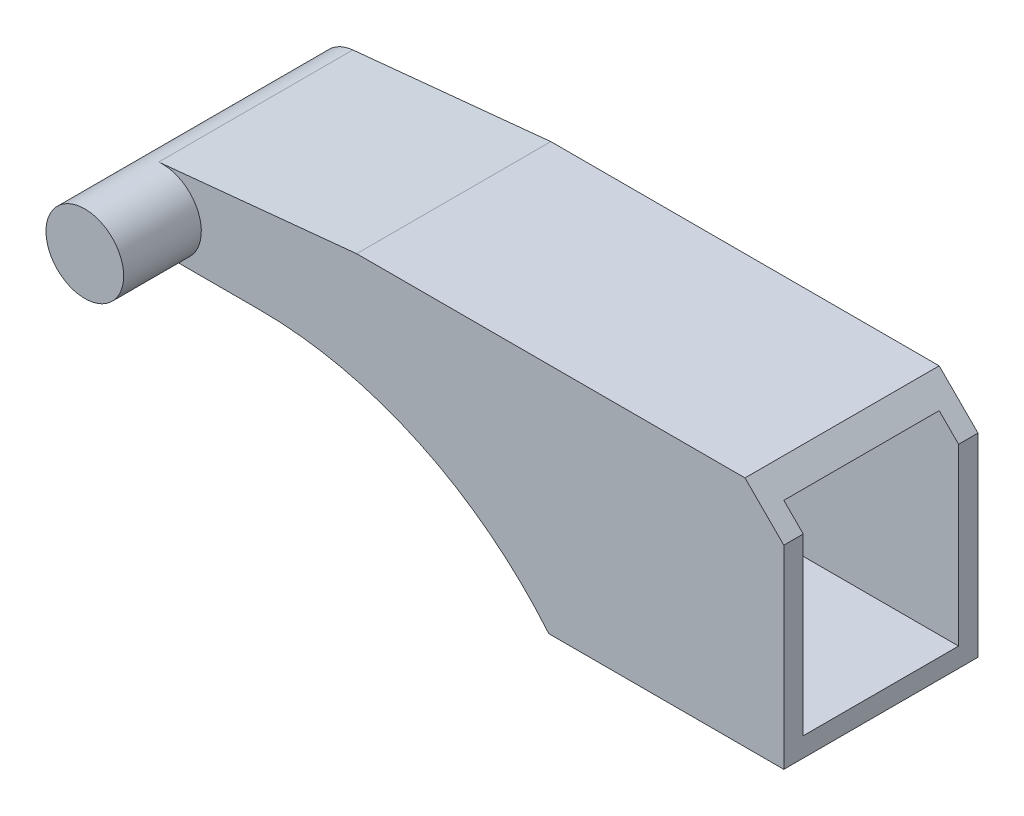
ISO-10303-21;
HEADER;
FILE_DESCRIPTION(('STEP AP214'),'2;1');
FILE_NAME('part.step','',(''),(''),'','','');
FILE_SCHEMA(('AUTOMOTIVE_DESIGN { 1 0 10303 214 1 1 1 1 }'));
ENDSEC;
DATA;
#1=APPLICATION_CONTEXT('core data for automotive mechanical design processes');
#2=APPLICATION_PROTOCOL_DEFINITION('international standard','automotive_design',2000,#1);
#3=PRODUCT_CONTEXT('',#1,'mechanical');
#4=PRODUCT('Part','Part','',(#3));
#5=PRODUCT_RELATED_PRODUCT_CATEGORY('part','',(#4));
#6=PRODUCT_DEFINITION_FORMATION('','',#4);
#7=PRODUCT_DEFINITION_CONTEXT('part definition',#1,'design');
#8=PRODUCT_DEFINITION('design','',#6,#7);
#9=PRODUCT_DEFINITION_SHAPE('','',#8);
#10=(LENGTH_UNIT() NAMED_UNIT(*) SI_UNIT(.MILLI.,.METRE.));
#11=(NAMED_UNIT(*) PLANE_ANGLE_UNIT() SI_UNIT($,.RADIAN.));
#12=(NAMED_UNIT(*) SI_UNIT($,.STERADIAN.) SOLID_ANGLE_UNIT());
#13=UNCERTAINTY_MEASURE_WITH_UNIT(LENGTH_MEASURE(1.E-05),#10,'distance_accuracy_value','');
#14=(GEOMETRIC_REPRESENTATION_CONTEXT(3) GLOBAL_UNCERTAINTY_ASSIGNED_CONTEXT((#13)) GLOBAL_UNIT_ASSIGNED_CONTEXT((#10,
#11,#12)) REPRESENTATION_CONTEXT('',''));
#15=CARTESIAN_POINT('',(0.,0.,0.));
#16=DIRECTION('',(0.,0.,1.));
#17=DIRECTION('',(1.,0.,0.));
#18=AXIS2_PLACEMENT_3D('',#15,#16,#17);
#19=CARTESIAN_POINT('',(-32.5857864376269,24.0857864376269,0.));
#20=DIRECTION('',(0.,0.,1.));
#21=DIRECTION('',(1.,0.,0.));
#22=AXIS2_PLACEMENT_3D('',#19,#20,#21);
#23=PLANE('',#22);
#24=DIRECTION('',(-0.995133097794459,-0.0985399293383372,0.));
#25=VECTOR('',#24,1.);
#26=CARTESIAN_POINT('',(-27.5857864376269,25.5857864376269,0.));
#27=LINE('',#26,#25);
#28=CARTESIAN_POINT('',(-27.5857864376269,25.5857864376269,0.));
#29=VERTEX_POINT('',#28);
#30=CARTESIAN_POINT('',(-32.6843263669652,25.0809195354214,0.));
#31=VERTEX_POINT('',#30);
#32=EDGE_CURVE('E152',#29,#31,#27,.T.);
#33=ORIENTED_EDGE('',*,*,#32,.F.);
#34=DIRECTION('',(-1.,0.,0.));
#35=VECTOR('',#34,1.);
#36=CARTESIAN_POINT('',(-17.5857864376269,25.5857864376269,0.));
#37=LINE('',#36,#35);
#38=CARTESIAN_POINT('',(-17.5857864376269,25.5857864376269,0.));
#39=VERTEX_POINT('',#38);
#40=EDGE_CURVE('E160',#39,#29,#37,.T.);
#41=ORIENTED_EDGE('',*,*,#40,.F.);
#42=DIRECTION('',(-0.70710678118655,0.707106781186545,0.));
#43=VECTOR('',#42,1.);
#44=CARTESIAN_POINT('',(-16.5857864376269,24.5857864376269,0.));
#45=LINE('',#44,#43);
#46=CARTESIAN_POINT('',(-16.5857864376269,24.5857864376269,0.));
#47=VERTEX_POINT('',#46);
#48=EDGE_CURVE('E204',#47,#39,#45,.T.);
#49=ORIENTED_EDGE('',*,*,#48,.F.);
#50=DIRECTION('',(0.,1.,0.));
#51=VECTOR('',#50,1.);
#52=CARTESIAN_POINT('',(-16.5857864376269,24.5857864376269,0.));
#53=LINE('',#52,#51);
#54=CARTESIAN_POINT('',(-16.5857864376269,19.5857864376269,0.));
#55=VERTEX_POINT('',#54);
#56=EDGE_CURVE('E206',#55,#47,#53,.T.);
#57=ORIENTED_EDGE('',*,*,#56,.F.);
#58=DIRECTION('',(1.,0.,0.));
#59=VECTOR('',#58,1.);
#60=CARTESIAN_POINT('',(-16.5857864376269,19.5857864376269,0.));
#61=LINE('',#60,#59);
#62=CARTESIAN_POINT('',(-22.6385212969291,19.5857864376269,0.));
#63=VERTEX_POINT('',#62);
#64=EDGE_CURVE('E209',#63,#55,#61,.T.);
#65=ORIENTED_EDGE('',*,*,#64,.F.);
#66=CARTESIAN_POINT('',(-30.0857864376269,13.4126781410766,0.));
#67=DIRECTION('',(0.,0.,-1.));
#68=DIRECTION('',(1.,0.,0.));
#69=AXIS2_PLACEMENT_3D('',#66,#67,#68);
#70=CIRCLE('',#69,9.67310829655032);
#71=CARTESIAN_POINT('',(-30.0857864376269,23.0857864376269,0.));
#72=VERTEX_POINT('',#71);
#73=EDGE_CURVE('E211',#72,#63,#70,.T.);
#74=ORIENTED_EDGE('',*,*,#73,.F.);
#75=DIRECTION('',(1.,0.,0.));
#76=VECTOR('',#75,1.);
#77=CARTESIAN_POINT('',(-32.5857864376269,23.0857864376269,0.));
#78=LINE('',#77,#76);
#79=CARTESIAN_POINT('',(-32.5857864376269,23.0857864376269,0.));
#80=VERTEX_POINT('',#79);
#81=EDGE_CURVE('E213',#80,#72,#78,.T.);
#82=ORIENTED_EDGE('',*,*,#81,.F.);
#83=CARTESIAN_POINT('',(-32.5857864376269,24.0857864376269,0.));
#84=DIRECTION('',(0.,0.,1.));
#85=DIRECTION('',(1.,0.,0.));
#86=AXIS2_PLACEMENT_3D('',#83,#84,#85);
#87=CIRCLE('',#86,1.);
#88=EDGE_CURVE('E215',#31,#80,#87,.T.);
#89=ORIENTED_EDGE('',*,*,#88,.F.);
#90=EDGE_LOOP('',(#33,#41,#49,#57,#65,#74,#82,#89));
#91=FACE_BOUND('',#90,.T.);
#92=CARTESIAN_POINT('',(-19.5857864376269,22.5857864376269,0.));
#93=DIRECTION('',(0.,0.,1.));
#94=DIRECTION('',(1.,0.,0.));
#95=AXIS2_PLACEMENT_3D('',#92,#93,#94);
#96=CIRCLE('',#95,1.5);
#97=CARTESIAN_POINT('',(-18.0857864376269,22.5857864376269,0.));
#98=VERTEX_POINT('',#97);
#99=EDGE_CURVE('E11',#98,#98,#96,.F.);
#100=ORIENTED_EDGE('',*,*,#99,.F.);
#101=EDGE_LOOP('',(#100));
#102=FACE_BOUND('',#101,.T.);
#103=ADVANCED_FACE('F32',(#91,#102),#23,.F.);
#104=CARTESIAN_POINT('',(-16.5857864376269,24.5857864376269,5.));
#105=DIRECTION('',(-1.,0.,0.));
#106=DIRECTION('',(0.,-1.,0.));
#107=AXIS2_PLACEMENT_3D('',#104,#105,#106);
#108=PLANE('',#107);
#109=DIRECTION('',(0.,1.,0.));
#110=VECTOR('',#109,1.);
#111=CARTESIAN_POINT('',(-16.5857864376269,24.5857864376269,4.5));
#112=LINE('',#111,#110);
#113=CARTESIAN_POINT('',(-16.5857864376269,20.0857864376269,4.5));
#114=VERTEX_POINT('',#113);
#115=CARTESIAN_POINT('',(-16.5857864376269,24.5857864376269,4.5));
#116=VERTEX_POINT('',#115);
#117=EDGE_CURVE('E47',#114,#116,#112,.T.);
#118=ORIENTED_EDGE('',*,*,#117,.T.);
#119=DIRECTION('',(0.,0.,-1.));
#120=VECTOR('',#119,1.);
#121=CARTESIAN_POINT('',(-16.5857864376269,24.5857864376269,5.));
#122=LINE('',#121,#120);
#123=CARTESIAN_POINT('',(-16.5857864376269,24.5857864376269,5.));
#124=VERTEX_POINT('',#123);
#125=EDGE_CURVE('E185',#124,#116,#122,.T.);
#126=ORIENTED_EDGE('',*,*,#125,.F.);
#127=DIRECTION('',(0.,1.,0.));
#128=VECTOR('',#127,1.);
#129=CARTESIAN_POINT('',(-16.5857864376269,24.5857864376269,5.));
#130=LINE('',#129,#128);
#131=CARTESIAN_POINT('',(-16.5857864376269,19.5857864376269,5.));
#132=VERTEX_POINT('',#131);
#133=EDGE_CURVE('E197',#132,#124,#130,.T.);
#134=ORIENTED_EDGE('',*,*,#133,.F.);
#135=DIRECTION('',(0.,0.,-1.));
#136=VECTOR('',#135,1.);
#137=CARTESIAN_POINT('',(-16.5857864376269,19.5857864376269,5.));
#138=LINE('',#137,#136);
#139=EDGE_CURVE('E182',#132,#55,#138,.T.);
#140=ORIENTED_EDGE('',*,*,#139,.T.);
#141=ORIENTED_EDGE('',*,*,#56,.T.);
#142=CARTESIAN_POINT('',(-16.5857864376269,24.5857864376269,0.5));
#143=VERTEX_POINT('',#142);
#144=EDGE_CURVE('E188',#143,#47,#122,.T.);
#145=ORIENTED_EDGE('',*,*,#144,.F.);
#146=DIRECTION('',(0.,1.,0.));
#147=VECTOR('',#146,1.);
#148=CARTESIAN_POINT('',(-16.5857864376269,24.5857864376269,0.5));
#149=LINE('',#148,#147);
#150=CARTESIAN_POINT('',(-16.5857864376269,20.0857864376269,0.5));
#151=VERTEX_POINT('',#150);
#152=EDGE_CURVE('E222',#151,#143,#149,.T.);
#153=ORIENTED_EDGE('',*,*,#152,.F.);
#154=DIRECTION('',(0.,0.,-1.));
#155=VECTOR('',#154,1.);
#156=CARTESIAN_POINT('',(-16.5857864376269,20.0857864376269,5.));
#157=LINE('',#156,#155);
#158=EDGE_CURVE('E226',#114,#151,#157,.T.);
#159=ORIENTED_EDGE('',*,*,#158,.F.);
#160=EDGE_LOOP('',(#118,#126,#134,#140,#141,#145,#153,#159));
#161=FACE_BOUND('',#160,.T.);
#162=ADVANCED_FACE('F291',(#161),#108,.F.);
#163=CARTESIAN_POINT('',(-27.5857864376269,25.5857864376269,5.));
#164=DIRECTION('',(0.0985399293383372,-0.995133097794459,0.));
#165=DIRECTION('',(0.995133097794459,0.0985399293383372,0.));
#166=AXIS2_PLACEMENT_3D('',#163,#164,#165);
#167=PLANE('',#166);
#168=ORIENTED_EDGE('',*,*,#32,.T.);
#169=DIRECTION('',(0.,0.,-1.));
#170=VECTOR('',#169,1.);
#171=CARTESIAN_POINT('',(-32.6843263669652,25.0809195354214,5.));
#172=LINE('',#171,#170);
#173=CARTESIAN_POINT('',(-32.6843263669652,25.0809195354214,5.));
#174=VERTEX_POINT('',#173);
#175=EDGE_CURVE('E148',#174,#31,#172,.T.);
#176=ORIENTED_EDGE('',*,*,#175,.F.);
#177=DIRECTION('',(-0.995133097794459,-0.0985399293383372,0.));
#178=VECTOR('',#177,1.);
#179=CARTESIAN_POINT('',(-27.5857864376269,25.5857864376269,5.));
#180=LINE('',#179,#178);
#181=CARTESIAN_POINT('',(-27.5857864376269,25.5857864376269,5.));
#182=VERTEX_POINT('',#181);
#183=EDGE_CURVE('E150',#182,#174,#180,.T.);
#184=ORIENTED_EDGE('',*,*,#183,.F.);
#185=DIRECTION('',(0.,0.,-1.));
#186=VECTOR('',#185,1.);
#187=CARTESIAN_POINT('',(-27.5857864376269,25.5857864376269,5.));
#188=LINE('',#187,#186);
#189=EDGE_CURVE('E192',#182,#29,#188,.T.);
#190=ORIENTED_EDGE('',*,*,#189,.T.);
#191=EDGE_LOOP('',(#168,#176,#184,#190));
#192=FACE_BOUND('',#191,.T.);
#193=ADVANCED_FACE('F34',(#192),#167,.F.);
#194=CARTESIAN_POINT('',(-32.5857864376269,24.0857864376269,5.));
#195=DIRECTION('',(0.,0.,-1.));
#196=DIRECTION('',(-1.,0.,0.));
#197=AXIS2_PLACEMENT_3D('',#194,#195,#196);
#198=CYLINDRICAL_SURFACE('',#197,1.);
#199=ORIENTED_EDGE('',*,*,#88,.T.);
#200=DIRECTION('',(0.,0.,-1.));
#201=VECTOR('',#200,1.);
#202=CARTESIAN_POINT('',(-32.5857864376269,23.0857864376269,5.));
#203=LINE('',#202,#201);
#204=CARTESIAN_POINT('',(-32.5857864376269,23.0857864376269,5.));
#205=VERTEX_POINT('',#204);
#206=EDGE_CURVE('E155',#205,#80,#203,.T.);
#207=ORIENTED_EDGE('',*,*,#206,.F.);
#208=CARTESIAN_POINT('',(-32.5857864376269,24.0857864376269,5.));
#209=DIRECTION('',(0.,0.,1.));
#210=DIRECTION('',(1.,0.,0.));
#211=AXIS2_PLACEMENT_3D('',#208,#209,#210);
#212=CIRCLE('',#211,0.999999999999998);
#213=EDGE_CURVE('E40',#205,#174,#212,.T.);
#214=ORIENTED_EDGE('',*,*,#213,.T.);
#215=ORIENTED_EDGE('',*,*,#175,.T.);
#216=EDGE_LOOP('',(#199,#207,#214,#215));
#217=FACE_BOUND('',#216,.T.);
#218=CARTESIAN_POINT('',(-32.5857864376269,24.0857864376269,7.));
#219=DIRECTION('',(0.,0.,1.));
#220=DIRECTION('',(1.,0.,0.));
#221=AXIS2_PLACEMENT_3D('',#218,#219,#220);
#222=CIRCLE('',#221,0.999999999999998);
#223=CARTESIAN_POINT('',(-31.5857864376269,24.0857864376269,7.));
#224=VERTEX_POINT('',#223);
#225=EDGE_CURVE('E274',#224,#224,#222,.T.);
#226=ORIENTED_EDGE('',*,*,#225,.F.);
#227=EDGE_LOOP('',(#226));
#228=FACE_BOUND('',#227,.T.);
#229=ADVANCED_FACE('F162',(#217,#228),#198,.T.);
#230=CARTESIAN_POINT('',(-32.5857864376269,23.0857864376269,5.));
#231=DIRECTION('',(0.,1.,0.));
#232=DIRECTION('',(0.,0.,1.));
#233=AXIS2_PLACEMENT_3D('',#230,#231,#232);
#234=PLANE('',#233);
#235=ORIENTED_EDGE('',*,*,#81,.T.);
#236=DIRECTION('',(0.,0.,-1.));
#237=VECTOR('',#236,1.);
#238=CARTESIAN_POINT('',(-30.0857864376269,23.0857864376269,5.));
#239=LINE('',#238,#237);
#240=CARTESIAN_POINT('',(-30.0857864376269,23.0857864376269,5.));
#241=VERTEX_POINT('',#240);
#242=EDGE_CURVE('E174',#241,#72,#239,.T.);
#243=ORIENTED_EDGE('',*,*,#242,.F.);
#244=DIRECTION('',(1.,0.,0.));
#245=VECTOR('',#244,1.);
#246=CARTESIAN_POINT('',(-32.5857864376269,23.0857864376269,5.));
#247=LINE('',#246,#245);
#248=EDGE_CURVE('E159',#205,#241,#247,.T.);
#249=ORIENTED_EDGE('',*,*,#248,.F.);
#250=ORIENTED_EDGE('',*,*,#206,.T.);
#251=EDGE_LOOP('',(#235,#243,#249,#250));
#252=FACE_BOUND('',#251,.T.);
#253=ADVANCED_FACE('F321',(#252),#234,.F.);
#254=CARTESIAN_POINT('',(-30.0857864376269,13.4126781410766,5.));
#255=DIRECTION('',(0.,0.,-1.));
#256=DIRECTION('',(-1.,0.,0.));
#257=AXIS2_PLACEMENT_3D('',#254,#255,#256);
#258=CYLINDRICAL_SURFACE('',#257,9.67310829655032);
#259=ORIENTED_EDGE('',*,*,#73,.T.);
#260=DIRECTION('',(0.,0.,-1.));
#261=VECTOR('',#260,1.);
#262=CARTESIAN_POINT('',(-22.6385212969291,19.5857864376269,5.));
#263=LINE('',#262,#261);
#264=CARTESIAN_POINT('',(-22.6385212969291,19.5857864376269,5.));
#265=VERTEX_POINT('',#264);
#266=EDGE_CURVE('E179',#265,#63,#263,.T.);
#267=ORIENTED_EDGE('',*,*,#266,.F.);
#268=CARTESIAN_POINT('',(-30.0857864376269,13.4126781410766,5.));
#269=DIRECTION('',(0.,0.,-1.));
#270=DIRECTION('',(1.,0.,0.));
#271=AXIS2_PLACEMENT_3D('',#268,#269,#270);
#272=CIRCLE('',#271,9.67310829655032);
#273=EDGE_CURVE('E201',#241,#265,#272,.T.);
#274=ORIENTED_EDGE('',*,*,#273,.F.);
#275=ORIENTED_EDGE('',*,*,#242,.T.);
#276=EDGE_LOOP('',(#259,#267,#274,#275));
#277=FACE_BOUND('',#276,.T.);
#278=ADVANCED_FACE('F317',(#277),#258,.F.);
#279=CARTESIAN_POINT('',(-16.5857864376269,19.5857864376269,5.));
#280=DIRECTION('',(0.,1.,0.));
#281=DIRECTION('',(0.,0.,1.));
#282=AXIS2_PLACEMENT_3D('',#279,#280,#281);
#283=PLANE('',#282);
#284=ORIENTED_EDGE('',*,*,#64,.T.);
#285=ORIENTED_EDGE('',*,*,#139,.F.);
#286=DIRECTION('',(1.,0.,0.));
#287=VECTOR('',#286,1.);
#288=CARTESIAN_POINT('',(-16.5857864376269,19.5857864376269,5.));
#289=LINE('',#288,#287);
#290=EDGE_CURVE('E199',#265,#132,#289,.T.);
#291=ORIENTED_EDGE('',*,*,#290,.F.);
#292=ORIENTED_EDGE('',*,*,#266,.T.);
#293=EDGE_LOOP('',(#284,#285,#291,#292));
#294=FACE_BOUND('',#293,.T.);
#295=ADVANCED_FACE('F312',(#294),#283,.F.);
#296=CARTESIAN_POINT('',(-16.5857864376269,24.5857864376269,5.));
#297=DIRECTION('',(-0.707106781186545,-0.70710678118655,0.));
#298=DIRECTION('',(0.70710678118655,-0.707106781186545,0.));
#299=AXIS2_PLACEMENT_3D('',#296,#297,#298);
#300=PLANE('',#299);
#301=ORIENTED_EDGE('',*,*,#125,.T.);
#302=DIRECTION('',(-0.70710678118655,0.707106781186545,0.));
#303=VECTOR('',#302,1.);
#304=CARTESIAN_POINT('',(-16.5857864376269,24.5857864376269,4.5));
#305=LINE('',#304,#303);
#306=CARTESIAN_POINT('',(-17.0857864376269,25.0857864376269,4.5));
#307=VERTEX_POINT('',#306);
#308=EDGE_CURVE('E265',#116,#307,#305,.T.);
#309=ORIENTED_EDGE('',*,*,#308,.T.);
#310=DIRECTION('',(0.,0.,-1.));
#311=VECTOR('',#310,1.);
#312=CARTESIAN_POINT('',(-17.0857864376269,25.0857864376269,5.));
#313=LINE('',#312,#311);
#314=CARTESIAN_POINT('',(-17.0857864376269,25.0857864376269,0.5));
#315=VERTEX_POINT('',#314);
#316=EDGE_CURVE('E271',#307,#315,#313,.T.);
#317=ORIENTED_EDGE('',*,*,#316,.T.);
#318=DIRECTION('',(0.70710678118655,-0.707106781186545,0.));
#319=VECTOR('',#318,1.);
#320=CARTESIAN_POINT('',(-16.5857864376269,24.5857864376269,0.5));
#321=LINE('',#320,#319);
#322=EDGE_CURVE('E268',#315,#143,#321,.T.);
#323=ORIENTED_EDGE('',*,*,#322,.T.);
#324=ORIENTED_EDGE('',*,*,#144,.T.);
#325=ORIENTED_EDGE('',*,*,#48,.T.);
#326=DIRECTION('',(0.,0.,-1.));
#327=VECTOR('',#326,1.);
#328=CARTESIAN_POINT('',(-17.5857864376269,25.5857864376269,5.));
#329=LINE('',#328,#327);
#330=CARTESIAN_POINT('',(-17.5857864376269,25.5857864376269,5.));
#331=VERTEX_POINT('',#330);
#332=EDGE_CURVE('E189',#331,#39,#329,.T.);
#333=ORIENTED_EDGE('',*,*,#332,.F.);
#334=DIRECTION('',(-0.70710678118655,0.707106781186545,0.));
#335=VECTOR('',#334,1.);
#336=CARTESIAN_POINT('',(-16.5857864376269,24.5857864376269,5.));
#337=LINE('',#336,#335);
#338=EDGE_CURVE('E195',#124,#331,#337,.T.);
#339=ORIENTED_EDGE('',*,*,#338,.F.);
#340=EDGE_LOOP('',(#301,#309,#317,#323,#324,#325,#333,#339));
#341=FACE_BOUND('',#340,.T.);
#342=ADVANCED_FACE('F309',(#341),#300,.F.);
#343=CARTESIAN_POINT('',(-17.5857864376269,25.5857864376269,5.));
#344=DIRECTION('',(0.,-1.,0.));
#345=DIRECTION('',(0.,0.,-1.));
#346=AXIS2_PLACEMENT_3D('',#343,#344,#345);
#347=PLANE('',#346);
#348=ORIENTED_EDGE('',*,*,#40,.T.);
#349=ORIENTED_EDGE('',*,*,#189,.F.);
#350=DIRECTION('',(-1.,0.,0.));
#351=VECTOR('',#350,1.);
#352=CARTESIAN_POINT('',(-17.5857864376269,25.5857864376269,5.));
#353=LINE('',#352,#351);
#354=EDGE_CURVE('E55',#331,#182,#353,.T.);
#355=ORIENTED_EDGE('',*,*,#354,.F.);
#356=ORIENTED_EDGE('',*,*,#332,.T.);
#357=EDGE_LOOP('',(#348,#349,#355,#356));
#358=FACE_BOUND('',#357,.T.);
#359=ADVANCED_FACE('F306',(#358),#347,.F.);
#360=CARTESIAN_POINT('',(-32.5857864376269,24.0857864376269,5.));
#361=DIRECTION('',(0.,0.,1.));
#362=DIRECTION('',(1.,0.,0.));
#363=AXIS2_PLACEMENT_3D('',#360,#361,#362);
#364=PLANE('',#363);
#365=ORIENTED_EDGE('',*,*,#213,.F.);
#366=ORIENTED_EDGE('',*,*,#248,.T.);
#367=ORIENTED_EDGE('',*,*,#273,.T.);
#368=ORIENTED_EDGE('',*,*,#290,.T.);
#369=ORIENTED_EDGE('',*,*,#133,.T.);
#370=ORIENTED_EDGE('',*,*,#338,.T.);
#371=ORIENTED_EDGE('',*,*,#354,.T.);
#372=ORIENTED_EDGE('',*,*,#183,.T.);
#373=EDGE_LOOP('',(#365,#366,#367,#368,#369,#370,#371,#372));
#374=FACE_BOUND('',#373,.T.);
#375=ADVANCED_FACE('F157',(#374),#364,.T.);
#376=CARTESIAN_POINT('',(-27.5365164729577,25.0882198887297,5.));
#377=DIRECTION('',(0.0985399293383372,-0.995133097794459,0.));
#378=DIRECTION('',(0.995133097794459,0.0985399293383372,0.));
#379=AXIS2_PLACEMENT_3D('',#376,#377,#378);
#380=PLANE('',#379);
#381=DIRECTION('',(-0.995133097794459,-0.0985399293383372,0.));
#382=VECTOR('',#381,1.);
#383=CARTESIAN_POINT('',(-27.5365164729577,25.0882198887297,0.5));
#384=LINE('',#383,#382);
#385=CARTESIAN_POINT('',(-27.561091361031,25.0857864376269,0.5));
#386=VERTEX_POINT('',#385);
#387=CARTESIAN_POINT('',(-32.6350564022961,24.5833529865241,0.5));
#388=VERTEX_POINT('',#387);
#389=EDGE_CURVE('E256',#386,#388,#384,.T.);
#390=ORIENTED_EDGE('',*,*,#389,.F.);
#391=DIRECTION('',(0.,0.,-1.));
#392=VECTOR('',#391,1.);
#393=CARTESIAN_POINT('',(-27.561091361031,25.0857864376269,5.));
#394=LINE('',#393,#392);
#395=CARTESIAN_POINT('',(-27.561091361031,25.0857864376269,4.5));
#396=VERTEX_POINT('',#395);
#397=EDGE_CURVE('E230',#396,#386,#394,.T.);
#398=ORIENTED_EDGE('',*,*,#397,.F.);
#399=DIRECTION('',(-0.995133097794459,-0.0985399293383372,0.));
#400=VECTOR('',#399,1.);
#401=CARTESIAN_POINT('',(-27.5365164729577,25.0882198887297,4.5));
#402=LINE('',#401,#400);
#403=CARTESIAN_POINT('',(-32.6350564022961,24.5833529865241,4.5));
#404=VERTEX_POINT('',#403);
#405=EDGE_CURVE('E232',#396,#404,#402,.T.);
#406=ORIENTED_EDGE('',*,*,#405,.T.);
#407=DIRECTION('',(0.,0.,-1.));
#408=VECTOR('',#407,1.);
#409=CARTESIAN_POINT('',(-32.6350564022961,24.5833529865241,5.));
#410=LINE('',#409,#408);
#411=EDGE_CURVE('E218',#404,#388,#410,.T.);
#412=ORIENTED_EDGE('',*,*,#411,.T.);
#413=EDGE_LOOP('',(#390,#398,#406,#412));
#414=FACE_BOUND('',#413,.T.);
#415=ADVANCED_FACE('F305',(#414),#380,.T.);
#416=CARTESIAN_POINT('',(-32.5857864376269,24.0857864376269,5.));
#417=DIRECTION('',(0.,0.,-1.));
#418=DIRECTION('',(-1.,0.,0.));
#419=AXIS2_PLACEMENT_3D('',#416,#417,#418);
#420=CYLINDRICAL_SURFACE('',#419,0.500000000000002);
#421=CARTESIAN_POINT('',(-32.5857864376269,24.0857864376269,0.5));
#422=DIRECTION('',(0.,0.,1.));
#423=DIRECTION('',(1.,0.,0.));
#424=AXIS2_PLACEMENT_3D('',#421,#422,#423);
#425=CIRCLE('',#424,0.500000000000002);
#426=CARTESIAN_POINT('',(-32.5857864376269,23.5857864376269,0.5));
#427=VERTEX_POINT('',#426);
#428=EDGE_CURVE('E251',#388,#427,#425,.T.);
#429=ORIENTED_EDGE('',*,*,#428,.F.);
#430=ORIENTED_EDGE('',*,*,#411,.F.);
#431=CARTESIAN_POINT('',(-32.5857864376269,24.0857864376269,4.5));
#432=DIRECTION('',(0.,0.,1.));
#433=DIRECTION('',(1.,0.,0.));
#434=AXIS2_PLACEMENT_3D('',#431,#432,#433);
#435=CIRCLE('',#434,0.500000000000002);
#436=CARTESIAN_POINT('',(-32.5857864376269,23.5857864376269,4.5));
#437=VERTEX_POINT('',#436);
#438=EDGE_CURVE('E246',#404,#437,#435,.T.);
#439=ORIENTED_EDGE('',*,*,#438,.T.);
#440=DIRECTION('',(0.,0.,1.));
#441=VECTOR('',#440,1.);
#442=CARTESIAN_POINT('',(-32.5857864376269,23.5857864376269,5.));
#443=LINE('',#442,#441);
#444=EDGE_CURVE('E249',#437,#427,#443,.F.);
#445=ORIENTED_EDGE('',*,*,#444,.T.);
#446=EDGE_LOOP('',(#429,#430,#439,#445));
#447=FACE_BOUND('',#446,.T.);
#448=ADVANCED_FACE('F436',(#447),#420,.F.);
#449=CARTESIAN_POINT('',(-32.5857864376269,23.5857864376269,5.));
#450=DIRECTION('',(0.,1.,0.));
#451=DIRECTION('',(0.,0.,1.));
#452=AXIS2_PLACEMENT_3D('',#449,#450,#451);
#453=PLANE('',#452);
#454=DIRECTION('',(1.,0.,0.));
#455=VECTOR('',#454,1.);
#456=CARTESIAN_POINT('',(-32.5857864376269,23.5857864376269,0.5));
#457=LINE('',#456,#455);
#458=CARTESIAN_POINT('',(-30.0857864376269,23.5857864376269,0.5));
#459=VERTEX_POINT('',#458);
#460=EDGE_CURVE('E244',#427,#459,#457,.T.);
#461=ORIENTED_EDGE('',*,*,#460,.F.);
#462=ORIENTED_EDGE('',*,*,#444,.F.);
#463=DIRECTION('',(1.,0.,0.));
#464=VECTOR('',#463,1.);
#465=CARTESIAN_POINT('',(-32.5857864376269,23.5857864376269,4.5));
#466=LINE('',#465,#464);
#467=CARTESIAN_POINT('',(-30.0857864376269,23.5857864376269,4.5));
#468=VERTEX_POINT('',#467);
#469=EDGE_CURVE('E239',#437,#468,#466,.T.);
#470=ORIENTED_EDGE('',*,*,#469,.T.);
#471=DIRECTION('',(0.,0.,-1.));
#472=VECTOR('',#471,1.);
#473=CARTESIAN_POINT('',(-30.0857864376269,23.5857864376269,5.));
#474=LINE('',#473,#472);
#475=EDGE_CURVE('E242',#468,#459,#474,.T.);
#476=ORIENTED_EDGE('',*,*,#475,.T.);
#477=EDGE_LOOP('',(#461,#462,#470,#476));
#478=FACE_BOUND('',#477,.T.);
#479=ADVANCED_FACE('F443',(#478),#453,.T.);
#480=CARTESIAN_POINT('',(-30.0857864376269,13.4126781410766,5.));
#481=DIRECTION('',(0.,0.,-1.));
#482=DIRECTION('',(-1.,0.,0.));
#483=AXIS2_PLACEMENT_3D('',#480,#481,#482);
#484=CYLINDRICAL_SURFACE('',#483,10.1731082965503);
#485=CARTESIAN_POINT('',(-30.0857864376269,13.4126781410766,0.5));
#486=DIRECTION('',(0.,0.,1.));
#487=DIRECTION('',(1.,0.,0.));
#488=AXIS2_PLACEMENT_3D('',#485,#486,#487);
#489=CIRCLE('',#488,10.1731082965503);
#490=CARTESIAN_POINT('',(-22.4071304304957,20.0857864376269,0.5));
#491=VERTEX_POINT('',#490);
#492=EDGE_CURVE('E237',#459,#491,#489,.F.);
#493=ORIENTED_EDGE('',*,*,#492,.F.);
#494=ORIENTED_EDGE('',*,*,#475,.F.);
#495=CARTESIAN_POINT('',(-30.0857864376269,13.4126781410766,4.5));
#496=DIRECTION('',(0.,0.,1.));
#497=DIRECTION('',(1.,0.,0.));
#498=AXIS2_PLACEMENT_3D('',#495,#496,#497);
#499=CIRCLE('',#498,10.1731082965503);
#500=CARTESIAN_POINT('',(-22.4071304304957,20.0857864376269,4.5));
#501=VERTEX_POINT('',#500);
#502=EDGE_CURVE('E235',#468,#501,#499,.F.);
#503=ORIENTED_EDGE('',*,*,#502,.T.);
#504=DIRECTION('',(0.,0.,-1.));
#505=VECTOR('',#504,1.);
#506=CARTESIAN_POINT('',(-22.4071304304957,20.0857864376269,4.5));
#507=LINE('',#506,#505);
#508=EDGE_CURVE('E229',#501,#491,#507,.T.);
#509=ORIENTED_EDGE('',*,*,#508,.T.);
#510=EDGE_LOOP('',(#493,#494,#503,#509));
#511=FACE_BOUND('',#510,.T.);
#512=ADVANCED_FACE('F451',(#511),#484,.T.);
#513=CARTESIAN_POINT('',(-16.5857864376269,20.0857864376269,5.));
#514=DIRECTION('',(0.,1.,0.));
#515=DIRECTION('',(0.,0.,1.));
#516=AXIS2_PLACEMENT_3D('',#513,#514,#515);
#517=PLANE('',#516);
#518=DIRECTION('',(1.,0.,0.));
#519=VECTOR('',#518,1.);
#520=CARTESIAN_POINT('',(-16.5857864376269,20.0857864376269,0.5));
#521=LINE('',#520,#519);
#522=EDGE_CURVE('E225',#491,#151,#521,.T.);
#523=ORIENTED_EDGE('',*,*,#522,.F.);
#524=ORIENTED_EDGE('',*,*,#508,.F.);
#525=DIRECTION('',(1.,0.,0.));
#526=VECTOR('',#525,1.);
#527=CARTESIAN_POINT('',(-16.5857864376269,20.0857864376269,4.5));
#528=LINE('',#527,#526);
#529=EDGE_CURVE('E221',#501,#114,#528,.T.);
#530=ORIENTED_EDGE('',*,*,#529,.T.);
#531=ORIENTED_EDGE('',*,*,#158,.T.);
#532=EDGE_LOOP('',(#523,#524,#530,#531));
#533=FACE_BOUND('',#532,.T.);
#534=ADVANCED_FACE('F344',(#533),#517,.T.);
#535=CARTESIAN_POINT('',(-17.5857864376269,25.0857864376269,5.));
#536=DIRECTION('',(0.,-1.,0.));
#537=DIRECTION('',(0.,0.,-1.));
#538=AXIS2_PLACEMENT_3D('',#535,#536,#537);
#539=PLANE('',#538);
#540=ORIENTED_EDGE('',*,*,#397,.T.);
#541=DIRECTION('',(-1.,0.,0.));
#542=VECTOR('',#541,1.);
#543=CARTESIAN_POINT('',(-17.5857864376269,25.0857864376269,0.5));
#544=LINE('',#543,#542);
#545=EDGE_CURVE('E224',#315,#386,#544,.T.);
#546=ORIENTED_EDGE('',*,*,#545,.F.);
#547=ORIENTED_EDGE('',*,*,#316,.F.);
#548=DIRECTION('',(-1.,0.,0.));
#549=VECTOR('',#548,1.);
#550=CARTESIAN_POINT('',(-17.5857864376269,25.0857864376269,4.5));
#551=LINE('',#550,#549);
#552=EDGE_CURVE('E220',#307,#396,#551,.T.);
#553=ORIENTED_EDGE('',*,*,#552,.T.);
#554=EDGE_LOOP('',(#540,#546,#547,#553));
#555=FACE_BOUND('',#554,.T.);
#556=ADVANCED_FACE('F357',(#555),#539,.T.);
#557=CARTESIAN_POINT('',(-32.5857864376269,24.0857864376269,4.5));
#558=DIRECTION('',(0.,0.,1.));
#559=DIRECTION('',(1.,0.,0.));
#560=AXIS2_PLACEMENT_3D('',#557,#558,#559);
#561=PLANE('',#560);
#562=ORIENTED_EDGE('',*,*,#552,.F.);
#563=ORIENTED_EDGE('',*,*,#308,.F.);
#564=ORIENTED_EDGE('',*,*,#117,.F.);
#565=ORIENTED_EDGE('',*,*,#529,.F.);
#566=ORIENTED_EDGE('',*,*,#502,.F.);
#567=ORIENTED_EDGE('',*,*,#469,.F.);
#568=ORIENTED_EDGE('',*,*,#438,.F.);
#569=ORIENTED_EDGE('',*,*,#405,.F.);
#570=EDGE_LOOP('',(#562,#563,#564,#565,#566,#567,#568,#569));
#571=FACE_BOUND('',#570,.T.);
#572=ADVANCED_FACE('F362',(#571),#561,.F.);
#573=CARTESIAN_POINT('',(-32.5857864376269,24.0857864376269,0.5));
#574=DIRECTION('',(0.,0.,1.));
#575=DIRECTION('',(1.,0.,0.));
#576=AXIS2_PLACEMENT_3D('',#573,#574,#575);
#577=PLANE('',#576);
#578=ORIENTED_EDGE('',*,*,#152,.T.);
#579=ORIENTED_EDGE('',*,*,#322,.F.);
#580=ORIENTED_EDGE('',*,*,#545,.T.);
#581=ORIENTED_EDGE('',*,*,#389,.T.);
#582=ORIENTED_EDGE('',*,*,#428,.T.);
#583=ORIENTED_EDGE('',*,*,#460,.T.);
#584=ORIENTED_EDGE('',*,*,#492,.T.);
#585=ORIENTED_EDGE('',*,*,#522,.T.);
#586=EDGE_LOOP('',(#578,#579,#580,#581,#582,#583,#584,#585));
#587=FACE_BOUND('',#586,.T.);
#588=ADVANCED_FACE('F301',(#587),#577,.T.);
#589=CARTESIAN_POINT('',(-32.5857864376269,24.0857864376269,7.));
#590=DIRECTION('',(0.,0.,1.));
#591=DIRECTION('',(1.,0.,0.));
#592=AXIS2_PLACEMENT_3D('',#589,#590,#591);
#593=PLANE('',#592);
#594=ORIENTED_EDGE('',*,*,#225,.T.);
#595=EDGE_LOOP('',(#594));
#596=FACE_BOUND('',#595,.T.);
#597=ADVANCED_FACE('F286',(#596),#593,.T.);
#598=CARTESIAN_POINT('',(-19.5857864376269,22.5857864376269,-0.5));
#599=DIRECTION('',(0.,0.,1.));
#600=DIRECTION('',(1.,0.,0.));
#601=AXIS2_PLACEMENT_3D('',#598,#599,#600);
#602=CYLINDRICAL_SURFACE('',#601,1.5);
#603=CARTESIAN_POINT('',(-19.5857864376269,22.5857864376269,-0.5));
#604=DIRECTION('',(0.,0.,-1.));
#605=DIRECTION('',(-1.,0.,0.));
#606=AXIS2_PLACEMENT_3D('',#603,#604,#605);
#607=CIRCLE('',#606,1.5);
#608=CARTESIAN_POINT('',(-21.0857864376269,22.5857864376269,-0.5));
#609=VERTEX_POINT('',#608);
#610=EDGE_CURVE('E277',#609,#609,#607,.T.);
#611=ORIENTED_EDGE('',*,*,#610,.F.);
#612=EDGE_LOOP('',(#611));
#613=FACE_BOUND('',#612,.T.);
#614=ORIENTED_EDGE('',*,*,#99,.T.);
#615=EDGE_LOOP('',(#614));
#616=FACE_BOUND('',#615,.T.);
#617=ADVANCED_FACE('F283',(#613,#616),#602,.T.);
#618=CARTESIAN_POINT('',(-19.5857864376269,22.5857864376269,-0.5));
#619=DIRECTION('',(0.,0.,-1.));
#620=DIRECTION('',(-1.,0.,0.));
#621=AXIS2_PLACEMENT_3D('',#618,#619,#620);
#622=PLANE('',#621);
#623=ORIENTED_EDGE('',*,*,#610,.T.);
#624=EDGE_LOOP('',(#623));
#625=FACE_BOUND('',#624,.T.);
#626=ADVANCED_FACE('F281',(#625),#622,.T.);
#627=CLOSED_SHELL('',(#103,#162,#193,#229,#253,#278,#295,#342,#359,#375,#415,#448,#479,#512,
#534,#556,#572,#588,#597,#617,#626));
#628=MANIFOLD_SOLID_BREP('B2',#627);
#629=ADVANCED_BREP_SHAPE_REPRESENTATION('',(#18,#628),#14);
#630=SHAPE_DEFINITION_REPRESENTATION(#9,#629);
ENDSEC;
END-ISO-10303-21;
